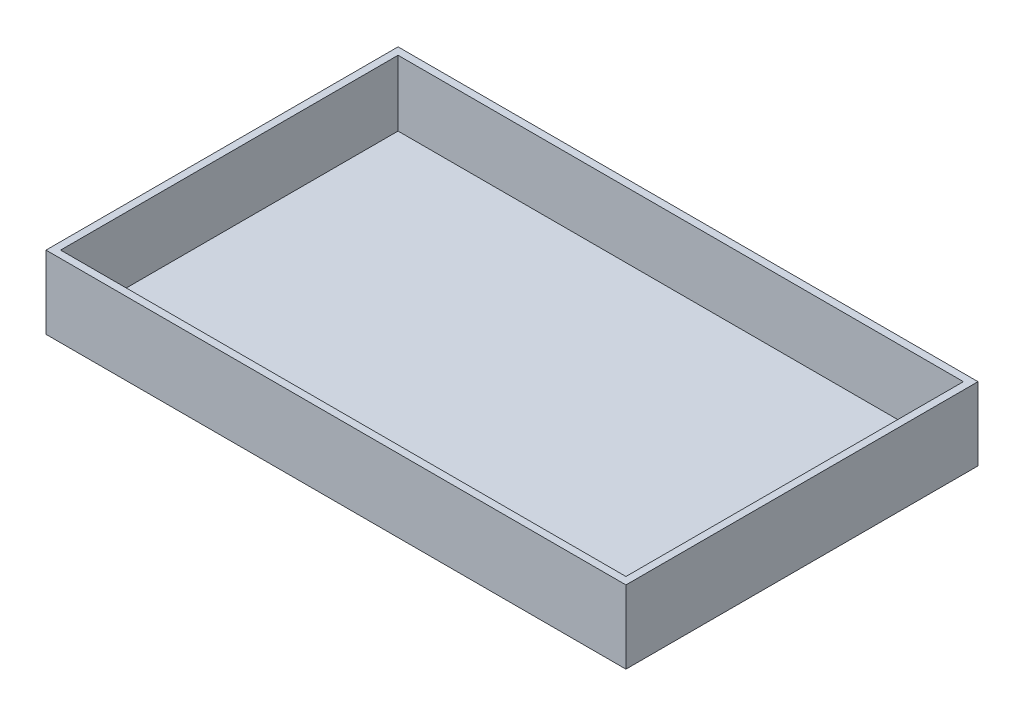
from build123d import *

# Parameters (mm, degrees)
SKETCH1_W      = 158.962516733
SKETCH1_H      = 96.499598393
EXTRUDE1_DEPTH = 20
SHELL1_T       = -2


with BuildPart() as part:
    # Sketch1 → Extrude1 (new body)
    with BuildSketch(Plane(origin=(0, 0, 0), x_dir=(1, 0, 0), z_dir=(0, 1, 0))):
        with Locations((1.122088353, 0.187014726)):
            Rectangle(SKETCH1_W, SKETCH1_H)
    extrude(amount=EXTRUDE1_DEPTH)

    # Shell1
    shell1_openings = [part.faces().sort_by_distance(p)[0] for p in [
        (1.122088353, 20, -0.187014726),
    ]]
    offset(amount=SHELL1_T, openings=shell1_openings, kind=Kind.INTERSECTION)


solid = part.part
